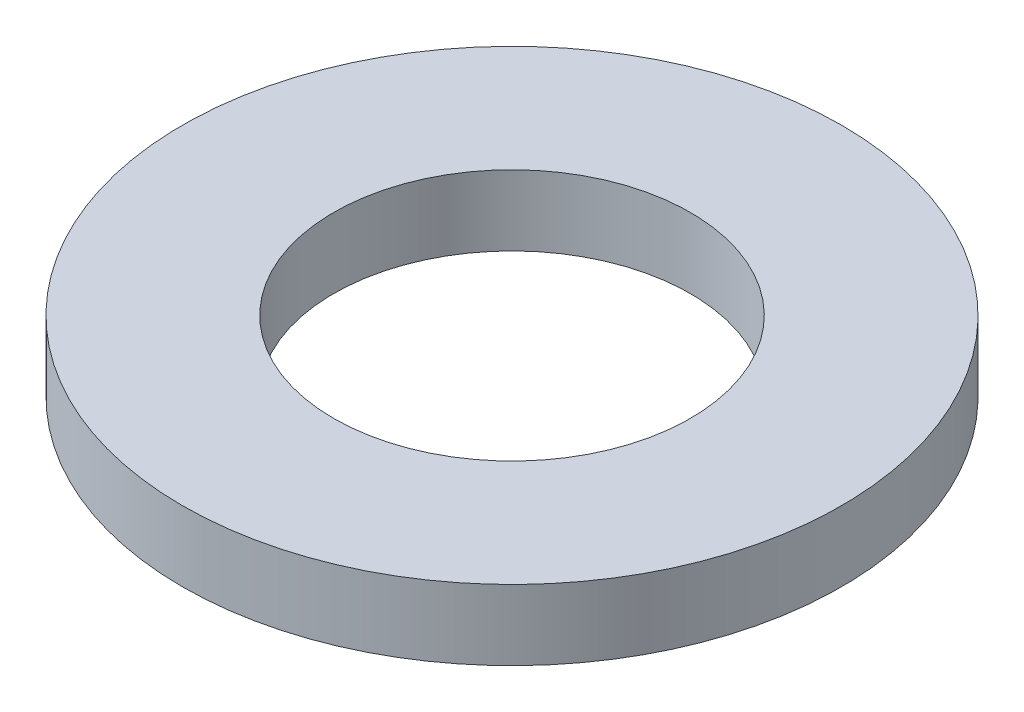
ISO-10303-21;
HEADER;
FILE_DESCRIPTION(('STEP AP214'),'2;1');
FILE_NAME('part.step','',(''),(''),'','','');
FILE_SCHEMA(('AUTOMOTIVE_DESIGN { 1 0 10303 214 1 1 1 1 }'));
ENDSEC;
DATA;
#1=APPLICATION_CONTEXT('core data for automotive mechanical design processes');
#2=APPLICATION_PROTOCOL_DEFINITION('international standard','automotive_design',2000,#1);
#3=PRODUCT_CONTEXT('',#1,'mechanical');
#4=PRODUCT('Part','Part','',(#3));
#5=PRODUCT_RELATED_PRODUCT_CATEGORY('part','',(#4));
#6=PRODUCT_DEFINITION_FORMATION('','',#4);
#7=PRODUCT_DEFINITION_CONTEXT('part definition',#1,'design');
#8=PRODUCT_DEFINITION('design','',#6,#7);
#9=PRODUCT_DEFINITION_SHAPE('','',#8);
#10=(LENGTH_UNIT() NAMED_UNIT(*) SI_UNIT(.MILLI.,.METRE.));
#11=(NAMED_UNIT(*) PLANE_ANGLE_UNIT() SI_UNIT($,.RADIAN.));
#12=(NAMED_UNIT(*) SI_UNIT($,.STERADIAN.) SOLID_ANGLE_UNIT());
#13=UNCERTAINTY_MEASURE_WITH_UNIT(LENGTH_MEASURE(1.E-05),#10,'distance_accuracy_value','');
#14=(GEOMETRIC_REPRESENTATION_CONTEXT(3) GLOBAL_UNCERTAINTY_ASSIGNED_CONTEXT((#13)) GLOBAL_UNIT_ASSIGNED_CONTEXT((#10,
#11,#12)) REPRESENTATION_CONTEXT('',''));
#15=CARTESIAN_POINT('',(0.,0.,0.));
#16=DIRECTION('',(0.,0.,1.));
#17=DIRECTION('',(1.,0.,0.));
#18=AXIS2_PLACEMENT_3D('',#15,#16,#17);
#19=CARTESIAN_POINT('',(0.,4.064,0.));
#20=DIRECTION('',(0.,-1.,0.));
#21=DIRECTION('',(0.,0.,-1.));
#22=AXIS2_PLACEMENT_3D('',#19,#20,#21);
#23=CYLINDRICAL_SURFACE('',#22,19.05);
#24=CARTESIAN_POINT('',(0.,4.064,0.));
#25=DIRECTION('',(0.,1.,0.));
#26=DIRECTION('',(0.,0.,1.));
#27=AXIS2_PLACEMENT_3D('',#24,#25,#26);
#28=CIRCLE('',#27,19.05);
#29=CARTESIAN_POINT('',(0.,4.064,19.05));
#30=VERTEX_POINT('',#29);
#31=EDGE_CURVE('E10',#30,#30,#28,.T.);
#32=ORIENTED_EDGE('',*,*,#31,.F.);
#33=EDGE_LOOP('',(#32));
#34=FACE_BOUND('',#33,.T.);
#35=CARTESIAN_POINT('',(0.,0.,0.));
#36=DIRECTION('',(0.,1.,0.));
#37=DIRECTION('',(0.,0.,1.));
#38=AXIS2_PLACEMENT_3D('',#35,#36,#37);
#39=CIRCLE('',#38,19.05);
#40=CARTESIAN_POINT('',(0.,0.,19.05));
#41=VERTEX_POINT('',#40);
#42=EDGE_CURVE('E39',#41,#41,#39,.T.);
#43=ORIENTED_EDGE('',*,*,#42,.T.);
#44=EDGE_LOOP('',(#43));
#45=FACE_BOUND('',#44,.T.);
#46=ADVANCED_FACE('F36',(#34,#45),#23,.T.);
#47=CARTESIAN_POINT('',(0.,4.064,0.));
#48=DIRECTION('',(0.,1.,0.));
#49=DIRECTION('',(0.,0.,1.));
#50=AXIS2_PLACEMENT_3D('',#47,#48,#49);
#51=PLANE('',#50);
#52=CARTESIAN_POINT('',(0.,4.064,0.));
#53=DIRECTION('',(0.,1.,0.));
#54=DIRECTION('',(0.,0.,1.));
#55=AXIS2_PLACEMENT_3D('',#52,#53,#54);
#56=CIRCLE('',#55,10.3124);
#57=CARTESIAN_POINT('',(0.,4.064,10.3124));
#58=VERTEX_POINT('',#57);
#59=EDGE_CURVE('E48',#58,#58,#56,.T.);
#60=ORIENTED_EDGE('',*,*,#59,.F.);
#61=EDGE_LOOP('',(#60));
#62=FACE_BOUND('',#61,.T.);
#63=ORIENTED_EDGE('',*,*,#31,.T.);
#64=EDGE_LOOP('',(#63));
#65=FACE_BOUND('',#64,.T.);
#66=ADVANCED_FACE('F63',(#62,#65),#51,.T.);
#67=CARTESIAN_POINT('',(0.,0.,0.));
#68=DIRECTION('',(0.,1.,0.));
#69=DIRECTION('',(0.,0.,1.));
#70=AXIS2_PLACEMENT_3D('',#67,#68,#69);
#71=PLANE('',#70);
#72=CARTESIAN_POINT('',(0.,0.,0.));
#73=DIRECTION('',(0.,1.,0.));
#74=DIRECTION('',(0.,0.,1.));
#75=AXIS2_PLACEMENT_3D('',#72,#73,#74);
#76=CIRCLE('',#75,10.3124);
#77=CARTESIAN_POINT('',(0.,0.,10.3124));
#78=VERTEX_POINT('',#77);
#79=EDGE_CURVE('E46',#78,#78,#76,.T.);
#80=ORIENTED_EDGE('',*,*,#79,.T.);
#81=EDGE_LOOP('',(#80));
#82=FACE_BOUND('',#81,.T.);
#83=ORIENTED_EDGE('',*,*,#42,.F.);
#84=EDGE_LOOP('',(#83));
#85=FACE_BOUND('',#84,.T.);
#86=ADVANCED_FACE('F54',(#82,#85),#71,.F.);
#87=CARTESIAN_POINT('',(0.,0.,0.));
#88=DIRECTION('',(0.,1.,0.));
#89=DIRECTION('',(0.,0.,1.));
#90=AXIS2_PLACEMENT_3D('',#87,#88,#89);
#91=CYLINDRICAL_SURFACE('',#90,10.3124);
#92=ORIENTED_EDGE('',*,*,#79,.F.);
#93=EDGE_LOOP('',(#92));
#94=FACE_BOUND('',#93,.T.);
#95=ORIENTED_EDGE('',*,*,#59,.T.);
#96=EDGE_LOOP('',(#95));
#97=FACE_BOUND('',#96,.T.);
#98=ADVANCED_FACE('F57',(#94,#97),#91,.F.);
#99=CLOSED_SHELL('',(#46,#66,#86,#98));
#100=MANIFOLD_SOLID_BREP('B2',#99);
#101=ADVANCED_BREP_SHAPE_REPRESENTATION('',(#18,#100),#14);
#102=SHAPE_DEFINITION_REPRESENTATION(#9,#101);
ENDSEC;
END-ISO-10303-21;
